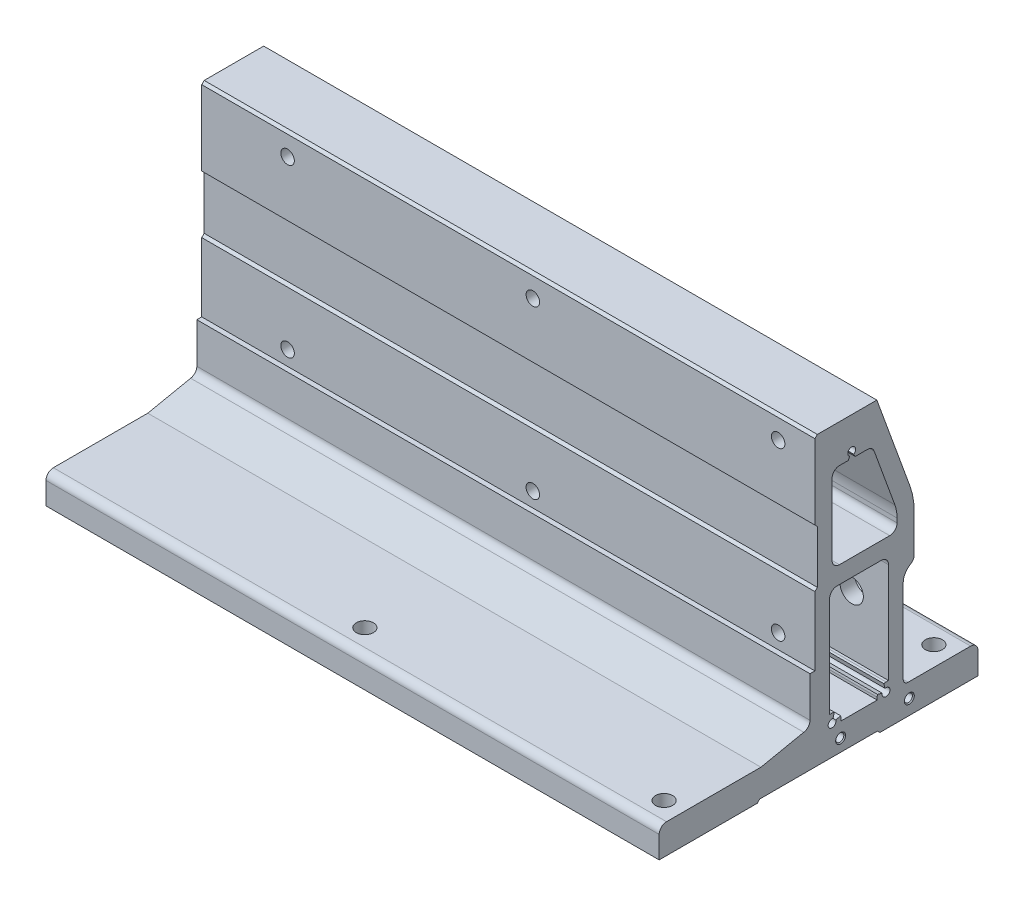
from build123d import *

# Parameters (mm, degrees)
EXTRUDE_1_DEPTH              = 125
HOLE_WIZARD_M5_1_D           = 5.5
HOLE_WIZARD_M5_1_CBORE_D     = 9.5
HOLE_WIZARD_M5_1_CBORE_DEPTH = 34.5
HOLE_WIZARD_M4_1_D           = 3.3
HOLE_WIZARD_M4_1_DEPTH       = 10
HOLE_WIZARD_M4_1_CSINK_D     = 4.05
HOLE_WIZARD_M4_1_CSINK_ANGLE = 90
HOLE_WIZARD_M4_1_TIP         = 0.991420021
F_5_0MM_1_D                  = 5
F_5_0MM_1_DEPTH              = 10
F_5_0MM_1_TIP                = 1.502151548
HOLE_WIZARD_7_0_7_1_D        = 7
PATTERN_LINEAR_1_COUNT       = 3
PATTERN_LINEAR_1_PITCH       = 100


with BuildPart() as part:
    # Sketch 1 → Extrude 1 (new, symmetric)
    with BuildSketch(Plane(origin=(0, 0, 0), x_dir=(0, 0, -1), z_dir=(1, 0, 0))):
        with BuildLine():
            Line((-1.5, 116), (-0.5, 117))
            Line((-0.5, 117), (23.753689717, 117))
            Line((23.753689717, 117), (37.190778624, 80.081901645))
            ThreePointArc((37.190778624, 80.081901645), (38.54423259, 75.030742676), (39, 69.821297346))
            Line((39, 69.821297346), (39, 54.794228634))
            ThreePointArc((39, 54.794228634), (38.598076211, 53.294228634), (37.5, 52.196152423))
            ThreePointArc((37.5, 52.196152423), (35.303847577, 50), (34.5, 47))
            Line((34.5, 47), (34.5, 13))
            ThreePointArc((34.5, 13), (35.085786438, 11.585786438), (36.5, 11))
            Line((36.5, 11), (62, 11))
            ThreePointArc((62, 11), (64.121320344, 10.121320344), (65, 8))
            Line((65, 8), (65, -1))
            Line((65, -1), (25, -1))
            Line((25, -1), (24, 0))
            Line((24, 0), (-24, 0))
            Line((-24, 0), (-25, -1))
            Line((-25, -1), (-65, -1))
            Line((-65, -1), (-65, 8))
            ThreePointArc((-65, 8), (-64.121320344, 10.121320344), (-62, 11))
            Line((-62, 11), (-23.5, 11))
            Line((-23.5, 11), (-6.035096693, 14.602337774))
            ThreePointArc((-6.035096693, 14.602337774), (-4.220229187, 15.616059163), (-3.5, 17.566096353))
            Line((-3.5, 17.566096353), (-3.5, 34))
            Line((-3.5, 34), (-1.5, 34))
            Line((-1.5, 34), (-1.5, 62))
            Line((-1.5, 62), (-0.5, 63))
            Line((-0.5, 63), (-0.5, 84.5))
            Line((-0.5, 84.5), (-1.5, 85.5))
            Line((-1.5, 85.5), (-1.5, 116))
        make_face()
        with BuildLine():
            Line((22.664439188, 99.52606043), (31.095389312, 76.362215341))
            ThreePointArc((31.095389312, 76.362215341), (31.772116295, 73.836635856), (32, 71.231913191))
            Line((32, 71.231913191), (32, 69.5))
            ThreePointArc((32, 69.5), (31.121320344, 67.378679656), (29, 66.5))
            Line((29, 66.5), (8.5, 66.5))
            ThreePointArc((8.5, 66.5), (6.378679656, 67.378679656), (5.5, 69.5))
            Line((5.5, 69.5), (5.5, 98.5))
            ThreePointArc((5.5, 98.5), (6.378679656, 100.621320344), (8.5, 101.5))
            Line((8.5, 101.5), (12.056626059, 101.5))
            Line((12.056626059, 101.5), (12.7, 102.614356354))
            ThreePointArc((12.7, 102.614356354), (13.5, 105.599997), (14.3, 102.614356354))
            Line((14.3, 102.614356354), (14.943373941, 101.5))
            Line((14.943373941, 101.5), (19.845361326, 101.5))
            ThreePointArc((19.845361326, 101.5), (21.566090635, 100.957456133), (22.664439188, 99.52606043))
        make_face(mode=Mode.SUBTRACT)
        with BuildLine():
            Line((28.5, 15.6), (28.5, 56.5))
            ThreePointArc((28.5, 56.5), (27.621320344, 58.621320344), (25.5, 59.5))
            Line((25.5, 59.5), (7.5, 59.5))
            ThreePointArc((7.5, 59.5), (5.378679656, 58.621320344), (4.5, 56.5))
            Line((4.5, 56.5), (4.5, 15.6))
            Line((4.5, 15.6), (5.5, 15.6))
            ThreePointArc((5.5, 15.6), (5.969894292, 15.569201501), (6.431748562, 15.477332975))
            Line((6.431748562, 15.477332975), (5.914110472, 13.545481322))
            ThreePointArc((5.914110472, 13.545481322), (4.36862915, 10.86862915), (7.045481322, 12.414110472))
            Line((7.045481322, 12.414110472), (8.977332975, 12.931748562))
            ThreePointArc((8.977332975, 12.931748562), (9.069201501, 12.469894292), (9.1, 12))
            Line((9.1, 12), (9.1, 11))
            Line((9.1, 11), (23.9, 11))
            Line((23.9, 11), (23.9, 12))
            ThreePointArc((23.9, 12), (23.930798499, 12.469894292), (24.022667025, 12.931748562))
            Line((24.022667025, 12.931748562), (25.954518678, 12.414110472))
            ThreePointArc((25.954518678, 12.414110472), (28.63137085, 10.86862915), (27.085889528, 13.545481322))
            Line((27.085889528, 13.545481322), (26.568251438, 15.477332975))
            ThreePointArc((26.568251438, 15.477332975), (27.030105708, 15.569201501), (27.5, 15.6))
            Line((27.5, 15.6), (28.5, 15.6))
        make_face(mode=Mode.SUBTRACT)
    extrude(amount=EXTRUDE_1_DEPTH, both=True)

    # Hole Wizard M5 _ _ _ _ _1 (through all)
    with Locations(Plane(origin=(0, 0, -39), x_dir=(-1, 0, 0), z_dir=(0, 0, -1))):
        with Locations((-110, 108), (-110, 40)):
            hole_wizard_m5_1 = CounterBoreHole(HOLE_WIZARD_M5_1_D / 2, HOLE_WIZARD_M5_1_CBORE_D / 2, HOLE_WIZARD_M5_1_CBORE_DEPTH)

    # Hole Wizard M4 _ _1
    with Locations(Plane(origin=(125, 0, 0), x_dir=(0, 0, -1), z_dir=(1, 0, 0))):
        with Locations((37, 5), (9, 5)):
            CounterSinkHole(HOLE_WIZARD_M4_1_D / 2, HOLE_WIZARD_M4_1_CSINK_D / 2, depth=HOLE_WIZARD_M4_1_DEPTH, counter_sink_angle=HOLE_WIZARD_M4_1_CSINK_ANGLE)
            with Locations((0, 0, -(HOLE_WIZARD_M4_1_DEPTH + HOLE_WIZARD_M4_1_TIP / 2))):  # 118° drill point
                Cone(0, HOLE_WIZARD_M4_1_D / 2, HOLE_WIZARD_M4_1_TIP, mode=Mode.SUBTRACT)

    # 5.0mm _ _1
    with Locations(Plane(origin=(0, 0, 0), x_dir=(-1, 0, 0), z_dir=(0, -1, 0))):
        with Locations((5, 0), (-117, 0)):
            Hole(F_5_0MM_1_D / 2, depth=F_5_0MM_1_DEPTH)
            with Locations((0, 0, -(F_5_0MM_1_DEPTH + F_5_0MM_1_TIP / 2))):  # 118° drill point
                Cone(0, F_5_0MM_1_D / 2, F_5_0MM_1_TIP, mode=Mode.SUBTRACT)

    # Hole Wizard 7.0 _7_ _ _1 (through all)
    with Locations(Plane(origin=(0, -1, 0), x_dir=(-1, 0, 0), z_dir=(0, -1, 0))):
        with Locations((5, -55), (5, 55), (-117, 55), (-117, -55)):
            Hole(HOLE_WIZARD_7_0_7_1_D / 2)

    # Pattern Linear 1: Hole Wizard M5 _ _ _ _ _1 ×3
    with Locations(*[(-i * PATTERN_LINEAR_1_PITCH, 0, 0) for i in range(1, PATTERN_LINEAR_1_COUNT)]):
        add(hole_wizard_m5_1, mode=Mode.SUBTRACT)


solid = part.part
